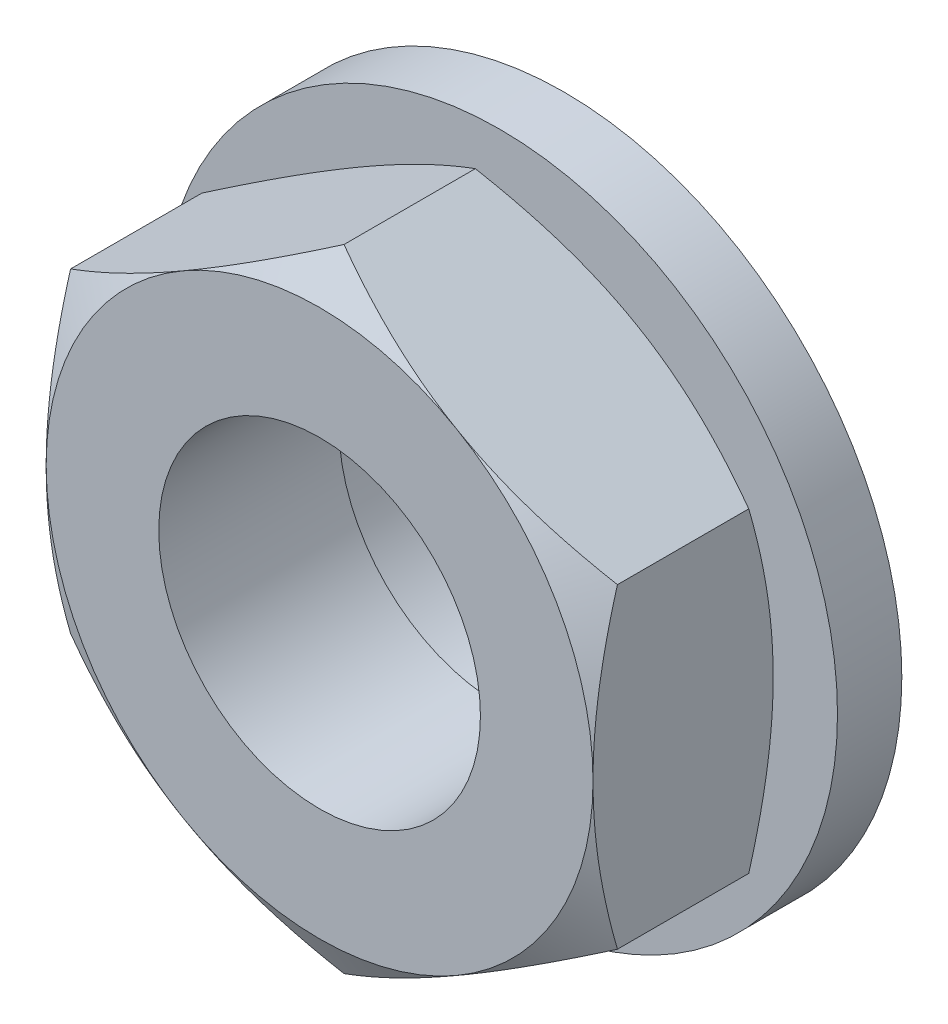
ISO-10303-21;
HEADER;
FILE_DESCRIPTION(('STEP AP214'),'2;1');
FILE_NAME('part.step','',(''),(''),'','','');
FILE_SCHEMA(('AUTOMOTIVE_DESIGN { 1 0 10303 214 1 1 1 1 }'));
ENDSEC;
DATA;
#1=APPLICATION_CONTEXT('core data for automotive mechanical design processes');
#2=APPLICATION_PROTOCOL_DEFINITION('international standard','automotive_design',2000,#1);
#3=PRODUCT_CONTEXT('',#1,'mechanical');
#4=PRODUCT('Part','Part','',(#3));
#5=PRODUCT_RELATED_PRODUCT_CATEGORY('part','',(#4));
#6=PRODUCT_DEFINITION_FORMATION('','',#4);
#7=PRODUCT_DEFINITION_CONTEXT('part definition',#1,'design');
#8=PRODUCT_DEFINITION('design','',#6,#7);
#9=PRODUCT_DEFINITION_SHAPE('','',#8);
#10=(LENGTH_UNIT() NAMED_UNIT(*) SI_UNIT(.MILLI.,.METRE.));
#11=(NAMED_UNIT(*) PLANE_ANGLE_UNIT() SI_UNIT($,.RADIAN.));
#12=(NAMED_UNIT(*) SI_UNIT($,.STERADIAN.) SOLID_ANGLE_UNIT());
#13=UNCERTAINTY_MEASURE_WITH_UNIT(LENGTH_MEASURE(1.E-05),#10,'distance_accuracy_value','');
#14=(GEOMETRIC_REPRESENTATION_CONTEXT(3) GLOBAL_UNCERTAINTY_ASSIGNED_CONTEXT((#13)) GLOBAL_UNIT_ASSIGNED_CONTEXT((#10,
#11,#12)) REPRESENTATION_CONTEXT('',''));
#15=CARTESIAN_POINT('',(0.,0.,0.));
#16=DIRECTION('',(0.,0.,1.));
#17=DIRECTION('',(1.,0.,0.));
#18=AXIS2_PLACEMENT_3D('',#15,#16,#17);
#19=CARTESIAN_POINT('',(8.5,4.90747728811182,7.6));
#20=DIRECTION('',(-0.5,-0.866025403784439,0.));
#21=DIRECTION('',(0.866025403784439,-0.5,0.));
#22=AXIS2_PLACEMENT_3D('',#19,#20,#21);
#23=PLANE('',#22);
#24=CARTESIAN_POINT('',(-0.000199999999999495,9.81507004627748,2.75925604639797));
#25=CARTESIAN_POINT('',(0.186639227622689,9.70719836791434,2.69698613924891));
#26=CARTESIAN_POINT('',(0.374175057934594,9.59892450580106,2.63754229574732));
#27=CARTESIAN_POINT('',(0.75076975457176,9.3814974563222,2.52508511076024));
#28=CARTESIAN_POINT('',(0.939829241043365,9.27234391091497,2.47207454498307));
#29=CARTESIAN_POINT('',(1.5100347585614,8.94313560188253,2.32373338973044));
#30=CARTESIAN_POINT('',(1.89343164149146,8.72178130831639,2.23935892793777));
#31=CARTESIAN_POINT('',(2.46717766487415,8.39052888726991,2.14042001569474));
#32=CARTESIAN_POINT('',(2.65581276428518,8.28162036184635,2.11223519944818));
#33=CARTESIAN_POINT('',(3.0339360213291,8.06331079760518,2.06497408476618));
#34=CARTESIAN_POINT('',(3.22342410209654,7.95390980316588,2.04589698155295));
#35=CARTESIAN_POINT('',(3.6027265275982,7.73491944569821,2.01733477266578));
#36=CARTESIAN_POINT('',(3.79254025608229,7.62533043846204,2.00783878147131));
#37=CARTESIAN_POINT('',(4.17234305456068,7.40605119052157,1.99864237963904));
#38=CARTESIAN_POINT('',(4.36233211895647,7.29636095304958,1.99894166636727));
#39=CARTESIAN_POINT('',(4.71752301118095,7.09129139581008,2.00865447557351));
#40=CARTESIAN_POINT('',(4.8827499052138,6.99589760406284,2.01688316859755));
#41=CARTESIAN_POINT('',(5.21281671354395,6.80533344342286,2.04058924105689));
#42=CARTESIAN_POINT('',(5.37765660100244,6.71016309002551,2.05606710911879));
#43=CARTESIAN_POINT('',(5.87153810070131,6.42502047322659,2.11300862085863));
#44=CARTESIAN_POINT('',(6.19970550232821,6.23555293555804,2.1649730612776));
#45=CARTESIAN_POINT('',(6.85952142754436,5.8546080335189,2.29488494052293));
#46=CARTESIAN_POINT('',(7.19108574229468,5.66317928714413,2.37338306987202));
#47=CARTESIAN_POINT('',(7.84926989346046,5.28317649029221,2.55154133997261));
#48=CARTESIAN_POINT('',(8.17589815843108,5.09459757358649,2.65115963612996));
#49=CARTESIAN_POINT('',(8.5002,4.90736181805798,2.75925604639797));
#50=B_SPLINE_CURVE_WITH_KNOTS('',3,(#24,#25,#26,#27,#28,#29,#30,#31,#32,#33,#34,#35,#36,#37,#38,
#39,#40,#41,#42,#43,#44,#45,#46,#47,#48,#49),.UNSPECIFIED.,.F.,.F.,(4,2,2,2,2,2,2,2,2,2,2,2,4),
(0.,0.673596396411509,1.34748239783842,2.69805431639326,3.356799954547,4.01548737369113,
4.67342558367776,5.33134346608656,5.9040955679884,6.47688628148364,7.62328361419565,
8.79510569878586,9.96462743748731),.UNSPECIFIED.);
#51=CARTESIAN_POINT('',(0.,9.81495457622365,2.75918937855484));
#52=VERTEX_POINT('',#51);
#53=CARTESIAN_POINT('',(4.25,7.36121593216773,2.));
#54=VERTEX_POINT('',#53);
#55=EDGE_CURVE('E116',#52,#54,#50,.T.);
#56=ORIENTED_EDGE('',*,*,#55,.F.);
#57=DIRECTION('',(0.,0.,-1.));
#58=VECTOR('',#57,1.);
#59=CARTESIAN_POINT('',(0.,9.81495457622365,7.6));
#60=LINE('',#59,#58);
#61=CARTESIAN_POINT('',(0.,9.81495457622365,6.84081062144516));
#62=VERTEX_POINT('',#61);
#63=EDGE_CURVE('E143',#62,#52,#60,.T.);
#64=ORIENTED_EDGE('',*,*,#63,.F.);
#65=CARTESIAN_POINT('',(8.5002,4.90736181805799,6.84074395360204));
#66=CARTESIAN_POINT('',(8.31336077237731,5.01523349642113,6.90301386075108));
#67=CARTESIAN_POINT('',(8.1258249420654,5.12350735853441,6.96245770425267));
#68=CARTESIAN_POINT('',(7.74923024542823,5.34093440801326,7.07491488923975));
#69=CARTESIAN_POINT('',(7.56017075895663,5.45008795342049,7.12792545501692));
#70=CARTESIAN_POINT('',(6.9899652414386,5.77929626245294,7.27626661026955));
#71=CARTESIAN_POINT('',(6.60656835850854,6.00065055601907,7.36064107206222));
#72=CARTESIAN_POINT('',(6.03282233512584,6.33190297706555,7.45957998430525));
#73=CARTESIAN_POINT('',(5.84418723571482,6.44081150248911,7.48776480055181));
#74=CARTESIAN_POINT('',(5.46606397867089,6.65912106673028,7.5350259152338));
#75=CARTESIAN_POINT('',(5.27657589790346,6.76852206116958,7.55410301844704));
#76=CARTESIAN_POINT('',(4.8972734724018,6.98751241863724,7.5826652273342));
#77=CARTESIAN_POINT('',(4.70745974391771,7.09710142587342,7.59216121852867));
#78=CARTESIAN_POINT('',(4.32765694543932,7.31638067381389,7.60135762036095));
#79=CARTESIAN_POINT('',(4.13766788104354,7.42607091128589,7.60105833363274));
#80=CARTESIAN_POINT('',(3.78247698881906,7.63114046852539,7.5913455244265));
#81=CARTESIAN_POINT('',(3.61725009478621,7.72653426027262,7.58311683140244));
#82=CARTESIAN_POINT('',(3.28718328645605,7.9170984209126,7.55941075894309));
#83=CARTESIAN_POINT('',(3.12234339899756,8.01226877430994,7.5439328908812));
#84=CARTESIAN_POINT('',(2.62846189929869,8.29741139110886,7.48699137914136));
#85=CARTESIAN_POINT('',(2.30029449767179,8.48687892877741,7.43502693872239));
#86=CARTESIAN_POINT('',(1.64047857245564,8.86782383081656,7.30511505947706));
#87=CARTESIAN_POINT('',(1.30891425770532,9.05925257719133,7.22661693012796));
#88=CARTESIAN_POINT('',(0.650730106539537,9.43925537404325,7.04845866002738));
#89=CARTESIAN_POINT('',(0.324101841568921,9.62783429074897,6.94884036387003));
#90=CARTESIAN_POINT('',(-0.000200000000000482,9.81507004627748,6.84074395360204));
#91=B_SPLINE_CURVE_WITH_KNOTS('',3,(#65,#66,#67,#68,#69,#70,#71,#72,#73,#74,#75,#76,#77,#78,#79,
#80,#81,#82,#83,#84,#85,#86,#87,#88,#89,#90),.UNSPECIFIED.,.F.,.F.,(4,2,2,2,2,2,2,2,2,2,2,2,4),
(0.,0.673596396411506,1.34748239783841,2.69805431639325,3.35679995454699,4.01548737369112,
4.67342558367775,5.33134346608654,5.90409556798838,6.47688628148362,7.62328361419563,
8.79510569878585,9.96462743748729),.UNSPECIFIED.);
#92=CARTESIAN_POINT('',(4.25,7.36121593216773,7.6));
#93=VERTEX_POINT('',#92);
#94=EDGE_CURVE('E208',#93,#62,#91,.T.);
#95=ORIENTED_EDGE('',*,*,#94,.F.);
#96=CARTESIAN_POINT('',(8.5,4.90747728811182,6.84081062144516));
#97=VERTEX_POINT('',#96);
#98=EDGE_CURVE('E215',#97,#93,#91,.T.);
#99=ORIENTED_EDGE('',*,*,#98,.F.);
#100=DIRECTION('',(0.,0.,-1.));
#101=VECTOR('',#100,1.);
#102=CARTESIAN_POINT('',(8.5,4.90747728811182,7.6));
#103=LINE('',#102,#101);
#104=CARTESIAN_POINT('',(8.5,4.90747728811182,2.75918937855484));
#105=VERTEX_POINT('',#104);
#106=EDGE_CURVE('E226',#97,#105,#103,.T.);
#107=ORIENTED_EDGE('',*,*,#106,.T.);
#108=EDGE_CURVE('E195',#54,#105,#50,.T.);
#109=ORIENTED_EDGE('',*,*,#108,.F.);
#110=EDGE_LOOP('',(#56,#64,#95,#99,#107,#109));
#111=FACE_BOUND('',#110,.T.);
#112=ADVANCED_FACE('F14',(#111),#23,.F.);
#113=CARTESIAN_POINT('',(0.,9.81495457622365,7.6));
#114=DIRECTION('',(0.5,-0.866025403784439,0.));
#115=DIRECTION('',(0.866025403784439,0.5,0.));
#116=AXIS2_PLACEMENT_3D('',#113,#114,#115);
#117=PLANE('',#116);
#118=CARTESIAN_POINT('',(-8.5002,4.90736181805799,2.75925604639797));
#119=CARTESIAN_POINT('',(-8.31336077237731,5.01523349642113,2.69698613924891));
#120=CARTESIAN_POINT('',(-8.12582494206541,5.12350735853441,2.63754229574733));
#121=CARTESIAN_POINT('',(-7.74923024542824,5.34093440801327,2.52508511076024));
#122=CARTESIAN_POINT('',(-7.56017075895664,5.4500879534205,2.47207454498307));
#123=CARTESIAN_POINT('',(-6.98996524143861,5.77929626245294,2.32373338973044));
#124=CARTESIAN_POINT('',(-6.60656835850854,6.00065055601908,2.23935892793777));
#125=CARTESIAN_POINT('',(-6.03282233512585,6.33190297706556,2.14042001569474));
#126=CARTESIAN_POINT('',(-5.84418723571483,6.44081150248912,2.11223519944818));
#127=CARTESIAN_POINT('',(-5.4660639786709,6.65912106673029,2.06497408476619));
#128=CARTESIAN_POINT('',(-5.27657589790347,6.76852206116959,2.04589698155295));
#129=CARTESIAN_POINT('',(-4.89727347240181,6.98751241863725,2.01733477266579));
#130=CARTESIAN_POINT('',(-4.70745974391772,7.09710142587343,2.00783878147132));
#131=CARTESIAN_POINT('',(-4.32765694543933,7.3163806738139,1.99864237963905));
#132=CARTESIAN_POINT('',(-4.13766788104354,7.42607091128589,1.99894166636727));
#133=CARTESIAN_POINT('',(-3.78247698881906,7.63114046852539,2.00865447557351));
#134=CARTESIAN_POINT('',(-3.61725009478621,7.72653426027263,2.01688316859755));
#135=CARTESIAN_POINT('',(-3.28718328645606,7.91709842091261,2.04058924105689));
#136=CARTESIAN_POINT('',(-3.12234339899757,8.01226877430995,2.05606710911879));
#137=CARTESIAN_POINT('',(-2.6284618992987,8.29741139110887,2.11300862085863));
#138=CARTESIAN_POINT('',(-2.3002944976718,8.48687892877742,2.1649730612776));
#139=CARTESIAN_POINT('',(-1.64047857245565,8.86782383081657,2.29488494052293));
#140=CARTESIAN_POINT('',(-1.30891425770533,9.05925257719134,2.37338306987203));
#141=CARTESIAN_POINT('',(-0.65073010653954,9.43925537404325,2.55154133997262));
#142=CARTESIAN_POINT('',(-0.324101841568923,9.62783429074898,2.65115963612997));
#143=CARTESIAN_POINT('',(0.000199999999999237,9.81507004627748,2.75925604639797));
#144=B_SPLINE_CURVE_WITH_KNOTS('',3,(#118,#119,#120,#121,#122,#123,#124,#125,#126,#127,#128,
#129,#130,#131,#132,#133,#134,#135,#136,#137,#138,#139,#140,#141,#142,#143),.UNSPECIFIED.,.F.,
.F.,(4,2,2,2,2,2,2,2,2,2,2,2,4),(0.,0.673596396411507,1.34748239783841,2.69805431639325,
3.35679995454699,4.01548737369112,4.67342558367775,5.33134346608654,5.90409556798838,
6.47688628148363,7.62328361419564,8.79510569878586,9.9646274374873),.UNSPECIFIED.);
#145=CARTESIAN_POINT('',(-8.5,4.90747728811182,2.75918937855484));
#146=VERTEX_POINT('',#145);
#147=CARTESIAN_POINT('',(-4.25,7.36121593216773,2.));
#148=VERTEX_POINT('',#147);
#149=EDGE_CURVE('E124',#146,#148,#144,.T.);
#150=ORIENTED_EDGE('',*,*,#149,.F.);
#151=DIRECTION('',(0.,0.,-1.));
#152=VECTOR('',#151,1.);
#153=CARTESIAN_POINT('',(-8.5,4.90747728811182,7.6));
#154=LINE('',#153,#152);
#155=CARTESIAN_POINT('',(-8.5,4.90747728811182,6.84081062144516));
#156=VERTEX_POINT('',#155);
#157=EDGE_CURVE('E240',#156,#146,#154,.T.);
#158=ORIENTED_EDGE('',*,*,#157,.F.);
#159=CARTESIAN_POINT('',(0.000200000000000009,9.81507004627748,6.84074395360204));
#160=CARTESIAN_POINT('',(-0.186639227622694,9.70719836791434,6.90301386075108));
#161=CARTESIAN_POINT('',(-0.374175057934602,9.59892450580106,6.96245770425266));
#162=CARTESIAN_POINT('',(-0.750769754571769,9.38149745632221,7.07491488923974));
#163=CARTESIAN_POINT('',(-0.939829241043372,9.27234391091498,7.12792545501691));
#164=CARTESIAN_POINT('',(-1.5100347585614,8.94313560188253,7.27626661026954));
#165=CARTESIAN_POINT('',(-1.89343164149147,8.72178130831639,7.36064107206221));
#166=CARTESIAN_POINT('',(-2.46717766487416,8.39052888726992,7.45957998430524));
#167=CARTESIAN_POINT('',(-2.65581276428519,8.28162036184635,7.4877648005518));
#168=CARTESIAN_POINT('',(-3.03393602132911,8.06331079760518,7.5350259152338));
#169=CARTESIAN_POINT('',(-3.22342410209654,7.95390980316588,7.55410301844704));
#170=CARTESIAN_POINT('',(-3.6027265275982,7.73491944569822,7.58266522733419));
#171=CARTESIAN_POINT('',(-3.79254025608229,7.62533043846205,7.59216121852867));
#172=CARTESIAN_POINT('',(-4.17234305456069,7.40605119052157,7.60135762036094));
#173=CARTESIAN_POINT('',(-4.36233211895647,7.29636095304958,7.60105833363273));
#174=CARTESIAN_POINT('',(-4.71752301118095,7.09129139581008,7.59134552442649));
#175=CARTESIAN_POINT('',(-4.8827499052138,6.99589760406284,7.58311683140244));
#176=CARTESIAN_POINT('',(-5.21281671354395,6.80533344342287,7.55941075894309));
#177=CARTESIAN_POINT('',(-5.37765660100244,6.71016309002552,7.54393289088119));
#178=CARTESIAN_POINT('',(-5.87153810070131,6.4250204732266,7.48699137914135));
#179=CARTESIAN_POINT('',(-6.19970550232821,6.23555293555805,7.43502693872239));
#180=CARTESIAN_POINT('',(-6.85952142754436,5.85460803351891,7.30511505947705));
#181=CARTESIAN_POINT('',(-7.19108574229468,5.66317928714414,7.22661693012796));
#182=CARTESIAN_POINT('',(-7.84926989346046,5.28317649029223,7.04845866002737));
#183=CARTESIAN_POINT('',(-8.17589815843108,5.0945975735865,6.94884036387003));
#184=CARTESIAN_POINT('',(-8.5002,4.90736181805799,6.84074395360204));
#185=B_SPLINE_CURVE_WITH_KNOTS('',3,(#159,#160,#161,#162,#163,#164,#165,#166,#167,#168,#169,
#170,#171,#172,#173,#174,#175,#176,#177,#178,#179,#180,#181,#182,#183,#184),.UNSPECIFIED.,.F.,
.F.,(4,2,2,2,2,2,2,2,2,2,2,2,4),(0.,0.673596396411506,1.34748239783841,2.69805431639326,
3.35679995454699,4.01548737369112,4.67342558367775,5.33134346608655,5.90409556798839,
6.47688628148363,7.62328361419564,8.79510569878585,9.96462743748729),.UNSPECIFIED.);
#186=CARTESIAN_POINT('',(-4.25,7.36121593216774,7.6));
#187=VERTEX_POINT('',#186);
#188=EDGE_CURVE('E217',#187,#156,#185,.T.);
#189=ORIENTED_EDGE('',*,*,#188,.F.);
#190=EDGE_CURVE('E216',#62,#187,#185,.T.);
#191=ORIENTED_EDGE('',*,*,#190,.F.);
#192=ORIENTED_EDGE('',*,*,#63,.T.);
#193=EDGE_CURVE('E114',#148,#52,#144,.T.);
#194=ORIENTED_EDGE('',*,*,#193,.F.);
#195=EDGE_LOOP('',(#150,#158,#189,#191,#192,#194));
#196=FACE_BOUND('',#195,.T.);
#197=ADVANCED_FACE('F140',(#196),#117,.F.);
#198=CARTESIAN_POINT('',(-8.5,4.90747728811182,7.6));
#199=DIRECTION('',(1.,0.,0.));
#200=DIRECTION('',(0.,1.,0.));
#201=AXIS2_PLACEMENT_3D('',#198,#199,#200);
#202=PLANE('',#201);
#203=CARTESIAN_POINT('',(-8.5,-13.1098417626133,6.11320175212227));
#204=CARTESIAN_POINT('',(-8.5,-12.7391954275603,5.93369675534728));
#205=CARTESIAN_POINT('',(-8.5,-12.3676904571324,5.75593394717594));
#206=CARTESIAN_POINT('',(-8.5,-11.6225063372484,5.40487402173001));
#207=CARTESIAN_POINT('',(-8.5,-11.2488268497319,5.23157762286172));
#208=CARTESIAN_POINT('',(-8.5,-10.496876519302,4.88954442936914));
#209=CARTESIAN_POINT('',(-8.5,-10.11859170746,4.72083823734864));
#210=CARTESIAN_POINT('',(-8.5,-9.35898804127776,4.39042698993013));
#211=CARTESIAN_POINT('',(-8.5,-8.97766933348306,4.2287215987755));
#212=CARTESIAN_POINT('',(-8.5,-8.19935475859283,3.90922176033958));
#213=CARTESIAN_POINT('',(-8.5,-7.80224246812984,3.75170933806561));
#214=CARTESIAN_POINT('',(-8.5,-7.0033462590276,3.44878149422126));
#215=CARTESIAN_POINT('',(-8.5,-6.60156181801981,3.30336744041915));
#216=CARTESIAN_POINT('',(-8.5,-5.79345296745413,3.02850734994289));
#217=CARTESIAN_POINT('',(-8.5,-5.38713989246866,2.89902835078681));
#218=CARTESIAN_POINT('',(-8.5,-4.56870092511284,2.66023889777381));
#219=CARTESIAN_POINT('',(-8.5,-4.15657693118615,2.55092201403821));
#220=CARTESIAN_POINT('',(-8.5,-3.32849200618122,2.35833664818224));
#221=CARTESIAN_POINT('',(-8.5,-2.91256426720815,2.27492933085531));
#222=CARTESIAN_POINT('',(-8.5,-2.28494353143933,2.17289615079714));
#223=CARTESIAN_POINT('',(-8.5,-2.07509909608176,2.14272998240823));
#224=CARTESIAN_POINT('',(-8.5,-1.65439193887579,2.09068352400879));
#225=CARTESIAN_POINT('',(-8.5,-1.44352931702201,2.06880243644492));
#226=CARTESIAN_POINT('',(-8.5,-1.02379063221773,2.03403273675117));
#227=CARTESIAN_POINT('',(-8.5,-0.814923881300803,2.02103213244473));
#228=CARTESIAN_POINT('',(-8.5,-0.396828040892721,2.00387004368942));
#229=CARTESIAN_POINT('',(-8.5,-0.187598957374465,1.99970841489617));
#230=CARTESIAN_POINT('',(-8.5,0.230848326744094,2.00032334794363));
#231=CARTESIAN_POINT('',(-8.5,0.440066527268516,2.00509996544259));
#232=CARTESIAN_POINT('',(-8.5,0.858117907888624,2.02347603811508));
#233=CARTESIAN_POINT('',(-8.5,1.06695106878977,2.03707592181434));
#234=CARTESIAN_POINT('',(-8.5,1.57106179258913,2.08026921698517));
#235=CARTESIAN_POINT('',(-8.5,1.86597643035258,2.11417214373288));
#236=CARTESIAN_POINT('',(-8.5,2.45357067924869,2.1977103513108));
#237=CARTESIAN_POINT('',(-8.5,2.74624997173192,2.24734783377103));
#238=CARTESIAN_POINT('',(-8.5,3.32911080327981,2.36058919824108));
#239=CARTESIAN_POINT('',(-8.5,3.61929015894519,2.42420421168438));
#240=CARTESIAN_POINT('',(-8.5,4.19671546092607,2.56346348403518));
#241=CARTESIAN_POINT('',(-8.5,4.48396145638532,2.63910754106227));
#242=CARTESIAN_POINT('',(-8.5,5.06177077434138,2.80235788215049));
#243=CARTESIAN_POINT('',(-8.5,5.35227022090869,2.89018869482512));
#244=CARTESIAN_POINT('',(-8.5,5.93040676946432,3.07476618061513));
#245=CARTESIAN_POINT('',(-8.5,6.21804385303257,3.17151291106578));
#246=CARTESIAN_POINT('',(-8.5,6.79060039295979,3.37240011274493));
#247=CARTESIAN_POINT('',(-8.5,7.07552075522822,3.47653801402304));
#248=CARTESIAN_POINT('',(-8.5,7.64301148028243,3.69099806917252));
#249=CARTESIAN_POINT('',(-8.5,7.92558186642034,3.80132016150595));
#250=CARTESIAN_POINT('',(-8.5,8.57470163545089,4.06163305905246));
#251=CARTESIAN_POINT('',(-8.5,8.94052064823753,4.21344201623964));
#252=CARTESIAN_POINT('',(-8.5,9.66918688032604,4.52405124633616));
#253=CARTESIAN_POINT('',(-8.5,10.032033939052,4.6828518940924));
#254=CARTESIAN_POINT('',(-8.5,10.7552864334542,5.0060929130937));
#255=CARTESIAN_POINT('',(-8.5,11.1156913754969,5.17053438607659));
#256=CARTESIAN_POINT('',(-8.5,11.8343806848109,5.5039602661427));
#257=CARTESIAN_POINT('',(-8.5,12.1926650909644,5.67294458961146));
#258=CARTESIAN_POINT('',(-8.5,12.9078084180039,6.0148032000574));
#259=CARTESIAN_POINT('',(-8.5,13.264665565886,6.18768119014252));
#260=CARTESIAN_POINT('',(-8.5,13.9768696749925,6.53652317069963));
#261=CARTESIAN_POINT('',(-8.5,14.332216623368,6.71248718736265));
#262=CARTESIAN_POINT('',(-8.5,15.3962572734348,7.24417106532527));
#263=CARTESIAN_POINT('',(-8.5,16.1030357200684,7.60372367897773));
#264=CARTESIAN_POINT('',(-8.5,17.4566110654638,8.30112194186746));
#265=CARTESIAN_POINT('',(-8.5,18.1036957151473,8.63841152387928));
#266=CARTESIAN_POINT('',(-8.5,19.3954345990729,9.31765809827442));
#267=CARTESIAN_POINT('',(-8.5,20.0400887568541,9.65961523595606));
#268=CARTESIAN_POINT('',(-8.5,21.3260050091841,10.3463113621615));
#269=CARTESIAN_POINT('',(-8.5,21.9672714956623,10.6910421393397));
#270=CARTESIAN_POINT('',(-8.5,23.248239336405,11.3833227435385));
#271=CARTESIAN_POINT('',(-8.5,23.8879407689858,11.7308724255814));
#272=CARTESIAN_POINT('',(-8.5,24.5270609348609,12.079480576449));
#273=B_SPLINE_CURVE_WITH_KNOTS('',3,(#203,#204,#205,#206,#207,#208,#209,#210,#211,#212,#213,
#214,#215,#216,#217,#218,#219,#220,#221,#222,#223,#224,#225,#226,#227,#228,#229,#230,#231,#232,
#233,#234,#235,#236,#237,#238,#239,#240,#241,#242,#243,#244,#245,#246,#247,#248,#249,#250,#251,
#252,#253,#254,#255,#256,#257,#258,#259,#260,#261,#262,#263,#264,#265,#266,#267,#268,#269,#270,
#271,#272),.UNSPECIFIED.,.F.,.F.,(4,2,2,2,2,2,2,2,2,2,2,2,2,2,2,2,2,2,2,2,2,2,2,2,2,2,2,2,2,2,2,
2,2,2,4),(0.,1.2354937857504,2.47118507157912,3.71372659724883,4.95620846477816,
6.23768538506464,7.51930698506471,8.79823126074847,10.0767469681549,11.3482886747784,
11.9841556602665,12.6199614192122,13.2475931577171,13.8752146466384,14.5028400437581,
15.1304959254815,16.0205726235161,16.9107739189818,17.8016867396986,18.6925846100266,
19.6028733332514,20.5131679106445,21.4231475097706,22.3331180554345,23.5212239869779,
24.7093936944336,25.8977968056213,27.086178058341,28.2757417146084,29.4653154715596,
31.8441801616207,34.0333023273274,36.2224927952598,38.4066460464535,40.5906876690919),.UNSPECIFIED.);
#274=CARTESIAN_POINT('',(-8.5,-4.90747728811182,2.75918937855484));
#275=VERTEX_POINT('',#274);
#276=CARTESIAN_POINT('',(-8.5,0.,2.));
#277=VERTEX_POINT('',#276);
#278=EDGE_CURVE('E336',#275,#277,#273,.T.);
#279=ORIENTED_EDGE('',*,*,#278,.F.);
#280=DIRECTION('',(0.,0.,-1.));
#281=VECTOR('',#280,1.);
#282=CARTESIAN_POINT('',(-8.5,-4.90747728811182,7.6));
#283=LINE('',#282,#281);
#284=CARTESIAN_POINT('',(-8.5,-4.90747728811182,6.84081062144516));
#285=VERTEX_POINT('',#284);
#286=EDGE_CURVE('E237',#285,#275,#283,.T.);
#287=ORIENTED_EDGE('',*,*,#286,.F.);
#288=CARTESIAN_POINT('',(-8.5,-13.1098417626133,3.48679824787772));
#289=CARTESIAN_POINT('',(-8.5,-12.7391954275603,3.66630324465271));
#290=CARTESIAN_POINT('',(-8.5,-12.3676904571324,3.84406605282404));
#291=CARTESIAN_POINT('',(-8.5,-11.6225063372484,4.19512597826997));
#292=CARTESIAN_POINT('',(-8.5,-11.2488268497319,4.36842237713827));
#293=CARTESIAN_POINT('',(-8.5,-10.496876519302,4.71045557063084));
#294=CARTESIAN_POINT('',(-8.5,-10.11859170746,4.87916176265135));
#295=CARTESIAN_POINT('',(-8.5,-9.35898804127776,5.20957301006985));
#296=CARTESIAN_POINT('',(-8.5,-8.97766933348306,5.37127840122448));
#297=CARTESIAN_POINT('',(-8.5,-8.19935475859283,5.69077823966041));
#298=CARTESIAN_POINT('',(-8.5,-7.80224246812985,5.84829066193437));
#299=CARTESIAN_POINT('',(-8.5,-7.0033462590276,6.15121850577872));
#300=CARTESIAN_POINT('',(-8.5,-6.60156181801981,6.29663255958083));
#301=CARTESIAN_POINT('',(-8.5,-5.79345296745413,6.5714926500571));
#302=CARTESIAN_POINT('',(-8.5,-5.38713989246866,6.70097164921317));
#303=CARTESIAN_POINT('',(-8.5,-4.56870092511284,6.93976110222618));
#304=CARTESIAN_POINT('',(-8.5,-4.15657693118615,7.04907798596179));
#305=CARTESIAN_POINT('',(-8.5,-3.32849200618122,7.24166335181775));
#306=CARTESIAN_POINT('',(-8.5,-2.91256426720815,7.32507066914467));
#307=CARTESIAN_POINT('',(-8.5,-2.28494353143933,7.42710384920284));
#308=CARTESIAN_POINT('',(-8.5,-2.07509909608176,7.45727001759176));
#309=CARTESIAN_POINT('',(-8.5,-1.65439193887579,7.5093164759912));
#310=CARTESIAN_POINT('',(-8.5,-1.44352931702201,7.53119756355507));
#311=CARTESIAN_POINT('',(-8.5,-1.02379063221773,7.56596726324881));
#312=CARTESIAN_POINT('',(-8.5,-0.814923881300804,7.57896786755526));
#313=CARTESIAN_POINT('',(-8.5,-0.396828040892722,7.59612995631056));
#314=CARTESIAN_POINT('',(-8.5,-0.187598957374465,7.60029158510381));
#315=CARTESIAN_POINT('',(-8.5,0.230848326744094,7.59967665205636));
#316=CARTESIAN_POINT('',(-8.5,0.440066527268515,7.59490003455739));
#317=CARTESIAN_POINT('',(-8.5,0.858117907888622,7.57652396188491));
#318=CARTESIAN_POINT('',(-8.5,1.06695106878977,7.56292407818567));
#319=CARTESIAN_POINT('',(-8.5,1.57106179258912,7.51973078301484));
#320=CARTESIAN_POINT('',(-8.5,1.86597643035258,7.48582785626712));
#321=CARTESIAN_POINT('',(-8.5,2.45357067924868,7.40228964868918));
#322=CARTESIAN_POINT('',(-8.5,2.74624997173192,7.35265216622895));
#323=CARTESIAN_POINT('',(-8.5,3.3291108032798,7.23941080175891));
#324=CARTESIAN_POINT('',(-8.5,3.61929015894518,7.17579578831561));
#325=CARTESIAN_POINT('',(-8.5,4.19671546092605,7.03653651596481));
#326=CARTESIAN_POINT('',(-8.5,4.48396145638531,6.96089245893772));
#327=CARTESIAN_POINT('',(-8.5,5.06177077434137,6.79764211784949));
#328=CARTESIAN_POINT('',(-8.5,5.35227022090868,6.70981130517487));
#329=CARTESIAN_POINT('',(-8.5,5.93040676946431,6.52523381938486));
#330=CARTESIAN_POINT('',(-8.5,6.21804385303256,6.42848708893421));
#331=CARTESIAN_POINT('',(-8.5,6.79060039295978,6.22759988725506));
#332=CARTESIAN_POINT('',(-8.5,7.07552075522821,6.12346198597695));
#333=CARTESIAN_POINT('',(-8.5,7.64301148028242,5.90900193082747));
#334=CARTESIAN_POINT('',(-8.5,7.92558186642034,5.79867983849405));
#335=CARTESIAN_POINT('',(-8.5,8.57470163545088,5.53836694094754));
#336=CARTESIAN_POINT('',(-8.5,8.94052064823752,5.38655798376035));
#337=CARTESIAN_POINT('',(-8.5,9.66918688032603,5.07594875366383));
#338=CARTESIAN_POINT('',(-8.5,10.032033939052,4.91714810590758));
#339=CARTESIAN_POINT('',(-8.5,10.7552864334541,4.5939070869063));
#340=CARTESIAN_POINT('',(-8.5,11.1156913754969,4.4294656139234));
#341=CARTESIAN_POINT('',(-8.5,11.8343806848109,4.09603973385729));
#342=CARTESIAN_POINT('',(-8.5,12.1926650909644,3.92705541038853));
#343=CARTESIAN_POINT('',(-8.5,12.9078084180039,3.58519679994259));
#344=CARTESIAN_POINT('',(-8.5,13.264665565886,3.41231880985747));
#345=CARTESIAN_POINT('',(-8.5,13.9768696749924,3.06347682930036));
#346=CARTESIAN_POINT('',(-8.5,14.332216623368,2.88751281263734));
#347=CARTESIAN_POINT('',(-8.5,15.3962572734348,2.35582893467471));
#348=CARTESIAN_POINT('',(-8.5,16.1030357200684,1.99627632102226));
#349=CARTESIAN_POINT('',(-8.5,17.4566110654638,1.29887805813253));
#350=CARTESIAN_POINT('',(-8.5,18.1036957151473,0.961588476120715));
#351=CARTESIAN_POINT('',(-8.5,19.3954345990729,0.282341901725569));
#352=CARTESIAN_POINT('',(-8.5,20.0400887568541,-0.0596152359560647));
#353=CARTESIAN_POINT('',(-8.5,21.3260050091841,-0.746311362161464));
#354=CARTESIAN_POINT('',(-8.5,21.9672714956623,-1.09104213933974));
#355=CARTESIAN_POINT('',(-8.5,23.248239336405,-1.78332274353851));
#356=CARTESIAN_POINT('',(-8.5,23.8879407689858,-2.13087242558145));
#357=CARTESIAN_POINT('',(-8.5,24.5270609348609,-2.47948057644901));
#358=B_SPLINE_CURVE_WITH_KNOTS('',3,(#288,#289,#290,#291,#292,#293,#294,#295,#296,#297,#298,
#299,#300,#301,#302,#303,#304,#305,#306,#307,#308,#309,#310,#311,#312,#313,#314,#315,#316,#317,
#318,#319,#320,#321,#322,#323,#324,#325,#326,#327,#328,#329,#330,#331,#332,#333,#334,#335,#336,
#337,#338,#339,#340,#341,#342,#343,#344,#345,#346,#347,#348,#349,#350,#351,#352,#353,#354,#355,
#356,#357),.UNSPECIFIED.,.F.,.F.,(4,2,2,2,2,2,2,2,2,2,2,2,2,2,2,2,2,2,2,2,2,2,2,2,2,2,2,2,2,2,2,
2,2,2,4),(0.,1.2354937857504,2.47118507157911,3.71372659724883,4.95620846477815,
6.23768538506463,7.5193069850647,8.79823126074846,10.0767469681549,11.3482886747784,
11.9841556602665,12.6199614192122,13.2475931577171,13.8752146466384,14.5028400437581,
15.1304959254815,16.0205726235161,16.9107739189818,17.8016867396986,18.6925846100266,
19.6028733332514,20.5131679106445,21.4231475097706,22.3331180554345,23.5212239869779,
24.7093936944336,25.8977968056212,27.0861780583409,28.2757417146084,29.4653154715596,
31.8441801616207,34.0333023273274,36.2224927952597,38.4066460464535,40.5906876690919),.UNSPECIFIED.);
#359=CARTESIAN_POINT('',(-8.5,0.,7.6));
#360=VERTEX_POINT('',#359);
#361=EDGE_CURVE('E317',#360,#285,#358,.F.);
#362=ORIENTED_EDGE('',*,*,#361,.F.);
#363=EDGE_CURVE('E322',#156,#360,#358,.F.);
#364=ORIENTED_EDGE('',*,*,#363,.F.);
#365=ORIENTED_EDGE('',*,*,#157,.T.);
#366=EDGE_CURVE('E128',#277,#146,#273,.T.);
#367=ORIENTED_EDGE('',*,*,#366,.F.);
#368=EDGE_LOOP('',(#279,#287,#362,#364,#365,#367));
#369=FACE_BOUND('',#368,.T.);
#370=ADVANCED_FACE('F323',(#369),#202,.F.);
#371=CARTESIAN_POINT('',(-8.5,-4.90747728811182,7.6));
#372=DIRECTION('',(0.5,0.866025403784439,0.));
#373=DIRECTION('',(-0.866025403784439,0.5,0.));
#374=AXIS2_PLACEMENT_3D('',#371,#372,#373);
#375=PLANE('',#374);
#376=CARTESIAN_POINT('',(0.000199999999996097,-9.81507004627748,2.75925604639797));
#377=CARTESIAN_POINT('',(-0.186639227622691,-9.70719836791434,2.69698613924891));
#378=CARTESIAN_POINT('',(-0.374175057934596,-9.59892450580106,2.63754229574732));
#379=CARTESIAN_POINT('',(-0.750769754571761,-9.3814974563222,2.52508511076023));
#380=CARTESIAN_POINT('',(-0.939829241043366,-9.27234391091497,2.47207454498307));
#381=CARTESIAN_POINT('',(-1.5100347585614,-8.94313560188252,2.32373338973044));
#382=CARTESIAN_POINT('',(-1.89343164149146,-8.72178130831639,2.23935892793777));
#383=CARTESIAN_POINT('',(-2.46717766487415,-8.39052888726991,2.14042001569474));
#384=CARTESIAN_POINT('',(-2.65581276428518,-8.28162036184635,2.11223519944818));
#385=CARTESIAN_POINT('',(-3.0339360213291,-8.06331079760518,2.06497408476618));
#386=CARTESIAN_POINT('',(-3.22342410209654,-7.95390980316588,2.04589698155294));
#387=CARTESIAN_POINT('',(-3.6027265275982,-7.73491944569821,2.01733477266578));
#388=CARTESIAN_POINT('',(-3.79254025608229,-7.62533043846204,2.00783878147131));
#389=CARTESIAN_POINT('',(-4.17234305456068,-7.40605119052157,1.99864237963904));
#390=CARTESIAN_POINT('',(-4.36233211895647,-7.29636095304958,1.99894166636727));
#391=CARTESIAN_POINT('',(-4.71752301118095,-7.09129139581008,2.00865447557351));
#392=CARTESIAN_POINT('',(-4.8827499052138,-6.99589760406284,2.01688316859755));
#393=CARTESIAN_POINT('',(-5.21281671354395,-6.80533344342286,2.04058924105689));
#394=CARTESIAN_POINT('',(-5.37765660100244,-6.71016309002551,2.05606710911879));
#395=CARTESIAN_POINT('',(-5.87153810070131,-6.42502047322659,2.11300862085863));
#396=CARTESIAN_POINT('',(-6.19970550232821,-6.23555293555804,2.1649730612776));
#397=CARTESIAN_POINT('',(-6.85952142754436,-5.8546080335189,2.29488494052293));
#398=CARTESIAN_POINT('',(-7.19108574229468,-5.66317928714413,2.37338306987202));
#399=CARTESIAN_POINT('',(-7.84926989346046,-5.28317649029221,2.55154133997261));
#400=CARTESIAN_POINT('',(-8.17589815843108,-5.09459757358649,2.65115963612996));
#401=CARTESIAN_POINT('',(-8.5002,-4.90736181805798,2.75925604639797));
#402=B_SPLINE_CURVE_WITH_KNOTS('',3,(#376,#377,#378,#379,#380,#381,#382,#383,#384,#385,#386,
#387,#388,#389,#390,#391,#392,#393,#394,#395,#396,#397,#398,#399,#400,#401),.UNSPECIFIED.,.F.,
.F.,(4,2,2,2,2,2,2,2,2,2,2,2,4),(0.,0.673596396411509,1.34748239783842,2.69805431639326,
3.35679995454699,4.01548737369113,4.67342558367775,5.33134346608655,5.9040955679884,
6.47688628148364,7.62328361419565,8.79510569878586,9.96462743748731),.UNSPECIFIED.);
#403=CARTESIAN_POINT('',(0.,-9.81495457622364,2.75918937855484));
#404=VERTEX_POINT('',#403);
#405=CARTESIAN_POINT('',(-4.25,-7.36121593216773,2.));
#406=VERTEX_POINT('',#405);
#407=EDGE_CURVE('E144',#404,#406,#402,.T.);
#408=ORIENTED_EDGE('',*,*,#407,.F.);
#409=DIRECTION('',(0.,0.,-1.));
#410=VECTOR('',#409,1.);
#411=CARTESIAN_POINT('',(0.,-9.81495457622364,7.6));
#412=LINE('',#411,#410);
#413=CARTESIAN_POINT('',(0.,-9.81495457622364,6.84081062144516));
#414=VERTEX_POINT('',#413);
#415=EDGE_CURVE('E234',#414,#404,#412,.T.);
#416=ORIENTED_EDGE('',*,*,#415,.F.);
#417=CARTESIAN_POINT('',(-8.5002,-4.90736181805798,6.84074395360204));
#418=CARTESIAN_POINT('',(-8.31336077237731,-5.01523349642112,6.90301386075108));
#419=CARTESIAN_POINT('',(-8.1258249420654,-5.1235073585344,6.96245770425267));
#420=CARTESIAN_POINT('',(-7.74923024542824,-5.34093440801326,7.07491488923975));
#421=CARTESIAN_POINT('',(-7.56017075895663,-5.45008795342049,7.12792545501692));
#422=CARTESIAN_POINT('',(-6.9899652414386,-5.77929626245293,7.27626661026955));
#423=CARTESIAN_POINT('',(-6.60656835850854,-6.00065055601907,7.36064107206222));
#424=CARTESIAN_POINT('',(-6.03282233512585,-6.33190297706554,7.45957998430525));
#425=CARTESIAN_POINT('',(-5.84418723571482,-6.44081150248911,7.4877648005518));
#426=CARTESIAN_POINT('',(-5.4660639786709,-6.65912106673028,7.5350259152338));
#427=CARTESIAN_POINT('',(-5.27657589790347,-6.76852206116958,7.55410301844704));
#428=CARTESIAN_POINT('',(-4.89727347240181,-6.98751241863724,7.5826652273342));
#429=CARTESIAN_POINT('',(-4.70745974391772,-7.09710142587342,7.59216121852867));
#430=CARTESIAN_POINT('',(-4.32765694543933,-7.31638067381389,7.60135762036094));
#431=CARTESIAN_POINT('',(-4.13766788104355,-7.42607091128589,7.60105833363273));
#432=CARTESIAN_POINT('',(-3.78247698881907,-7.63114046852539,7.59134552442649));
#433=CARTESIAN_POINT('',(-3.61725009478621,-7.72653426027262,7.58311683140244));
#434=CARTESIAN_POINT('',(-3.28718328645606,-7.9170984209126,7.5594107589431));
#435=CARTESIAN_POINT('',(-3.12234339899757,-8.01226877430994,7.5439328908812));
#436=CARTESIAN_POINT('',(-2.6284618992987,-8.29741139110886,7.48699137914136));
#437=CARTESIAN_POINT('',(-2.3002944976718,-8.48687892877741,7.43502693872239));
#438=CARTESIAN_POINT('',(-1.64047857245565,-8.86782383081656,7.30511505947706));
#439=CARTESIAN_POINT('',(-1.30891425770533,-9.05925257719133,7.22661693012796));
#440=CARTESIAN_POINT('',(-0.650730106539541,-9.43925537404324,7.04845866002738));
#441=CARTESIAN_POINT('',(-0.324101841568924,-9.62783429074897,6.94884036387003));
#442=CARTESIAN_POINT('',(0.000199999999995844,-9.81507004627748,6.84074395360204));
#443=B_SPLINE_CURVE_WITH_KNOTS('',3,(#417,#418,#419,#420,#421,#422,#423,#424,#425,#426,#427,
#428,#429,#430,#431,#432,#433,#434,#435,#436,#437,#438,#439,#440,#441,#442),.UNSPECIFIED.,.F.,
.F.,(4,2,2,2,2,2,2,2,2,2,2,2,4),(0.,0.673596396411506,1.34748239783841,2.69805431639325,
3.35679995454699,4.01548737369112,4.67342558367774,5.33134346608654,5.90409556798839,
6.47688628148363,7.62328361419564,8.79510569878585,9.96462743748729),.UNSPECIFIED.);
#444=CARTESIAN_POINT('',(-4.25,-7.36121593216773,7.6));
#445=VERTEX_POINT('',#444);
#446=EDGE_CURVE('E311',#445,#414,#443,.T.);
#447=ORIENTED_EDGE('',*,*,#446,.F.);
#448=EDGE_CURVE('E316',#285,#445,#443,.T.);
#449=ORIENTED_EDGE('',*,*,#448,.F.);
#450=ORIENTED_EDGE('',*,*,#286,.T.);
#451=EDGE_CURVE('E132',#406,#275,#402,.T.);
#452=ORIENTED_EDGE('',*,*,#451,.F.);
#453=EDGE_LOOP('',(#408,#416,#447,#449,#450,#452));
#454=FACE_BOUND('',#453,.T.);
#455=ADVANCED_FACE('F298',(#454),#375,.F.);
#456=CARTESIAN_POINT('',(0.,-9.81495457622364,7.6));
#457=DIRECTION('',(-0.5,0.866025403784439,0.));
#458=DIRECTION('',(-0.866025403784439,-0.5,0.));
#459=AXIS2_PLACEMENT_3D('',#456,#457,#458);
#460=PLANE('',#459);
#461=CARTESIAN_POINT('',(8.5002,-4.90736181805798,2.75925604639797));
#462=CARTESIAN_POINT('',(8.31336077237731,-5.01523349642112,2.69698613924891));
#463=CARTESIAN_POINT('',(8.12582494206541,-5.1235073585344,2.63754229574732));
#464=CARTESIAN_POINT('',(7.74923024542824,-5.34093440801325,2.52508511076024));
#465=CARTESIAN_POINT('',(7.56017075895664,-5.45008795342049,2.47207454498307));
#466=CARTESIAN_POINT('',(6.98996524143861,-5.77929626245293,2.32373338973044));
#467=CARTESIAN_POINT('',(6.60656835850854,-6.00065055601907,2.23935892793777));
#468=CARTESIAN_POINT('',(6.03282233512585,-6.33190297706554,2.14042001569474));
#469=CARTESIAN_POINT('',(5.84418723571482,-6.44081150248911,2.11223519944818));
#470=CARTESIAN_POINT('',(5.4660639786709,-6.65912106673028,2.06497408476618));
#471=CARTESIAN_POINT('',(5.27657589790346,-6.76852206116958,2.04589698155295));
#472=CARTESIAN_POINT('',(4.89727347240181,-6.98751241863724,2.01733477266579));
#473=CARTESIAN_POINT('',(4.70745974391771,-7.09710142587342,2.00783878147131));
#474=CARTESIAN_POINT('',(4.32765694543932,-7.31638067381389,1.99864237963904));
#475=CARTESIAN_POINT('',(4.13766788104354,-7.42607091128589,1.99894166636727));
#476=CARTESIAN_POINT('',(3.78247698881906,-7.63114046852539,2.00865447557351));
#477=CARTESIAN_POINT('',(3.61725009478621,-7.72653426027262,2.01688316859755));
#478=CARTESIAN_POINT('',(3.28718328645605,-7.9170984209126,2.04058924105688));
#479=CARTESIAN_POINT('',(3.12234339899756,-8.01226877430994,2.05606710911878));
#480=CARTESIAN_POINT('',(2.62846189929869,-8.29741139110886,2.11300862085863));
#481=CARTESIAN_POINT('',(2.30029449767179,-8.48687892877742,2.16497306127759));
#482=CARTESIAN_POINT('',(1.64047857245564,-8.86782383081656,2.29488494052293));
#483=CARTESIAN_POINT('',(1.30891425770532,-9.05925257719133,2.37338306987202));
#484=CARTESIAN_POINT('',(0.650730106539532,-9.43925537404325,2.55154133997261));
#485=CARTESIAN_POINT('',(0.324101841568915,-9.62783429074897,2.65115963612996));
#486=CARTESIAN_POINT('',(-0.00020000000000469,-9.81507004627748,2.75925604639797));
#487=B_SPLINE_CURVE_WITH_KNOTS('',3,(#461,#462,#463,#464,#465,#466,#467,#468,#469,#470,#471,
#472,#473,#474,#475,#476,#477,#478,#479,#480,#481,#482,#483,#484,#485,#486),.UNSPECIFIED.,.F.,
.F.,(4,2,2,2,2,2,2,2,2,2,2,2,4),(0.,0.673596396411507,1.34748239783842,2.69805431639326,
3.35679995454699,4.01548737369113,4.67342558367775,5.33134346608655,5.90409556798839,
6.47688628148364,7.62328361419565,8.79510569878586,9.96462743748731),.UNSPECIFIED.);
#488=CARTESIAN_POINT('',(8.5,-4.90747728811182,2.75918937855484));
#489=VERTEX_POINT('',#488);
#490=CARTESIAN_POINT('',(4.25,-7.36121593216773,2.));
#491=VERTEX_POINT('',#490);
#492=EDGE_CURVE('E188',#489,#491,#487,.T.);
#493=ORIENTED_EDGE('',*,*,#492,.F.);
#494=DIRECTION('',(0.,0.,-1.));
#495=VECTOR('',#494,1.);
#496=CARTESIAN_POINT('',(8.5,-4.90747728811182,7.6));
#497=LINE('',#496,#495);
#498=CARTESIAN_POINT('',(8.5,-4.90747728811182,6.84081062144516));
#499=VERTEX_POINT('',#498);
#500=EDGE_CURVE('E232',#499,#489,#497,.T.);
#501=ORIENTED_EDGE('',*,*,#500,.F.);
#502=CARTESIAN_POINT('',(-0.000200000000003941,-9.81507004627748,6.84074395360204));
#503=CARTESIAN_POINT('',(0.186639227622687,-9.70719836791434,6.90301386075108));
#504=CARTESIAN_POINT('',(0.374175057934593,-9.59892450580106,6.96245770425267));
#505=CARTESIAN_POINT('',(0.750769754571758,-9.3814974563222,7.07491488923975));
#506=CARTESIAN_POINT('',(0.939829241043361,-9.27234391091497,7.12792545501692));
#507=CARTESIAN_POINT('',(1.51003475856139,-8.94313560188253,7.27626661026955));
#508=CARTESIAN_POINT('',(1.89343164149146,-8.72178130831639,7.36064107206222));
#509=CARTESIAN_POINT('',(2.46717766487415,-8.39052888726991,7.45957998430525));
#510=CARTESIAN_POINT('',(2.65581276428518,-8.28162036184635,7.48776480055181));
#511=CARTESIAN_POINT('',(3.0339360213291,-8.06331079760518,7.5350259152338));
#512=CARTESIAN_POINT('',(3.22342410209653,-7.95390980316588,7.55410301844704));
#513=CARTESIAN_POINT('',(3.60272652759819,-7.73491944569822,7.5826652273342));
#514=CARTESIAN_POINT('',(3.79254025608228,-7.62533043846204,7.59216121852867));
#515=CARTESIAN_POINT('',(4.17234305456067,-7.40605119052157,7.60135762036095));
#516=CARTESIAN_POINT('',(4.36233211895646,-7.29636095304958,7.60105833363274));
#517=CARTESIAN_POINT('',(4.71752301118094,-7.09129139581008,7.5913455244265));
#518=CARTESIAN_POINT('',(4.88274990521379,-6.99589760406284,7.58311683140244));
#519=CARTESIAN_POINT('',(5.21281671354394,-6.80533344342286,7.5594107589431));
#520=CARTESIAN_POINT('',(5.37765660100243,-6.71016309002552,7.5439328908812));
#521=CARTESIAN_POINT('',(5.8715381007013,-6.4250204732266,7.48699137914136));
#522=CARTESIAN_POINT('',(6.1997055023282,-6.23555293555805,7.43502693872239));
#523=CARTESIAN_POINT('',(6.85952142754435,-5.8546080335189,7.30511505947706));
#524=CARTESIAN_POINT('',(7.19108574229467,-5.66317928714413,7.22661693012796));
#525=CARTESIAN_POINT('',(7.84926989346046,-5.28317649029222,7.04845866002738));
#526=CARTESIAN_POINT('',(8.17589815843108,-5.09459757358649,6.94884036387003));
#527=CARTESIAN_POINT('',(8.5002,-4.90736181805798,6.84074395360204));
#528=B_SPLINE_CURVE_WITH_KNOTS('',3,(#502,#503,#504,#505,#506,#507,#508,#509,#510,#511,#512,
#513,#514,#515,#516,#517,#518,#519,#520,#521,#522,#523,#524,#525,#526,#527),.UNSPECIFIED.,.F.,
.F.,(4,2,2,2,2,2,2,2,2,2,2,2,4),(0.,0.673596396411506,1.34748239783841,2.69805431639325,
3.35679995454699,4.01548737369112,4.67342558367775,5.33134346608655,5.90409556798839,
6.47688628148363,7.62328361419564,8.79510569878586,9.9646274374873),.UNSPECIFIED.);
#529=CARTESIAN_POINT('',(4.25,-7.36121593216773,7.6));
#530=VERTEX_POINT('',#529);
#531=EDGE_CURVE('E303',#530,#499,#528,.T.);
#532=ORIENTED_EDGE('',*,*,#531,.F.);
#533=EDGE_CURVE('E309',#414,#530,#528,.T.);
#534=ORIENTED_EDGE('',*,*,#533,.F.);
#535=ORIENTED_EDGE('',*,*,#415,.T.);
#536=EDGE_CURVE('E146',#491,#404,#487,.T.);
#537=ORIENTED_EDGE('',*,*,#536,.F.);
#538=EDGE_LOOP('',(#493,#501,#532,#534,#535,#537));
#539=FACE_BOUND('',#538,.T.);
#540=ADVANCED_FACE('F294',(#539),#460,.F.);
#541=CARTESIAN_POINT('',(8.5,-4.90747728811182,7.6));
#542=DIRECTION('',(-1.,0.,0.));
#543=DIRECTION('',(0.,0.,1.));
#544=AXIS2_PLACEMENT_3D('',#541,#542,#543);
#545=PLANE('',#544);
#546=CARTESIAN_POINT('',(8.5,-13.1098417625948,6.11320175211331));
#547=CARTESIAN_POINT('',(8.5,-12.7391954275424,5.93369675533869));
#548=CARTESIAN_POINT('',(8.5,-12.3676904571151,5.75593394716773));
#549=CARTESIAN_POINT('',(8.5,-11.6225063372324,5.40487402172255));
#550=CARTESIAN_POINT('',(8.5,-11.2488268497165,5.23157762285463));
#551=CARTESIAN_POINT('',(8.5,-10.4968765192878,4.8895444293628));
#552=CARTESIAN_POINT('',(8.5,-10.1185917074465,4.72083823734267));
#553=CARTESIAN_POINT('',(8.5,-9.35898804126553,4.39042698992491));
#554=CARTESIAN_POINT('',(8.5,-8.97766933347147,4.22872159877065));
#555=CARTESIAN_POINT('',(8.5,-8.19935475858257,3.90922176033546));
#556=CARTESIAN_POINT('',(8.5,-7.80224246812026,3.75170933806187));
#557=CARTESIAN_POINT('',(8.5,-7.00334625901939,3.44878149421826));
#558=CARTESIAN_POINT('',(8.5,-6.6015618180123,3.3033674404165));
#559=CARTESIAN_POINT('',(8.5,-5.79345296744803,3.02850734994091));
#560=CARTESIAN_POINT('',(8.5,-5.38713989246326,2.89902835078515));
#561=CARTESIAN_POINT('',(8.5,-4.56870092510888,2.66023889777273));
#562=CARTESIAN_POINT('',(8.5,-4.15657693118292,2.55092201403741));
#563=CARTESIAN_POINT('',(8.5,-3.32849200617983,2.35833664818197));
#564=CARTESIAN_POINT('',(8.5,-2.91256426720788,2.27492933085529));
#565=CARTESIAN_POINT('',(8.5,-2.28494353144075,2.17289615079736));
#566=CARTESIAN_POINT('',(8.5,-2.07509909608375,2.14272998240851));
#567=CARTESIAN_POINT('',(8.5,-1.65439193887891,2.09068352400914));
#568=CARTESIAN_POINT('',(8.5,-1.44352931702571,2.06880243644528));
#569=CARTESIAN_POINT('',(8.5,-1.02379063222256,2.03403273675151));
#570=CARTESIAN_POINT('',(8.5,-0.814923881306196,2.02103213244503));
#571=CARTESIAN_POINT('',(8.5,-0.396828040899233,2.00387004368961));
#572=CARTESIAN_POINT('',(8.5,-0.187598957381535,1.99970841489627));
#573=CARTESIAN_POINT('',(8.5,0.230848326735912,2.0003233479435));
#574=CARTESIAN_POINT('',(8.5,0.440066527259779,2.00509996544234));
#575=CARTESIAN_POINT('',(8.5,0.858117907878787,2.02347603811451));
#576=CARTESIAN_POINT('',(8.5,1.06695106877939,2.03707592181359));
#577=CARTESIAN_POINT('',(8.5,1.57106179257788,2.08026921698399));
#578=CARTESIAN_POINT('',(8.5,1.86597643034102,2.11417214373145));
#579=CARTESIAN_POINT('',(8.5,2.45357067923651,2.19771035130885));
#580=CARTESIAN_POINT('',(8.5,2.74624997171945,2.24734783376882));
#581=CARTESIAN_POINT('',(8.5,3.32911080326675,2.36058919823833));
#582=CARTESIAN_POINT('',(8.5,3.61929015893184,2.42420421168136));
#583=CARTESIAN_POINT('',(8.5,4.19671546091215,2.56346348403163));
#584=CARTESIAN_POINT('',(8.5,4.48396145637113,2.63910754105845));
#585=CARTESIAN_POINT('',(8.5,5.06177077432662,2.80235788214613));
#586=CARTESIAN_POINT('',(8.5,5.35227022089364,2.89018869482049));
#587=CARTESIAN_POINT('',(8.5,5.9304067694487,3.07476618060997));
#588=CARTESIAN_POINT('',(8.5,6.21804385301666,3.17151291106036));
#589=CARTESIAN_POINT('',(8.5,6.79060039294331,3.37240011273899));
#590=CARTESIAN_POINT('',(8.5,7.07552075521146,3.47653801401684));
#591=CARTESIAN_POINT('',(8.5,7.64301148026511,3.69099806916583));
#592=CARTESIAN_POINT('',(8.5,7.92558186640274,3.80132016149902));
#593=CARTESIAN_POINT('',(8.5,8.57470163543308,4.06163305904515));
#594=CARTESIAN_POINT('',(8.5,8.9405206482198,4.21344201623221));
#595=CARTESIAN_POINT('',(8.5,9.66918688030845,4.52405124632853));
#596=CARTESIAN_POINT('',(8.5,10.0320339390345,4.68285189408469));
#597=CARTESIAN_POINT('',(8.5,10.7552864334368,5.00609291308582));
#598=CARTESIAN_POINT('',(8.5,11.1156913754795,5.17053438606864));
#599=CARTESIAN_POINT('',(8.5,11.8343806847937,5.50396026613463));
#600=CARTESIAN_POINT('',(8.5,12.1926650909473,5.67294458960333));
#601=CARTESIAN_POINT('',(8.5,12.9078084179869,6.01480320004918));
#602=CARTESIAN_POINT('',(8.5,13.264665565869,6.18768119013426));
#603=CARTESIAN_POINT('',(8.5,13.9768696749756,6.5365231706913));
#604=CARTESIAN_POINT('',(8.5,14.3322166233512,6.71248718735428));
#605=CARTESIAN_POINT('',(8.5,15.3962572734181,7.24417106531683));
#606=CARTESIAN_POINT('',(8.5,16.1030357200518,7.60372367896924));
#607=CARTESIAN_POINT('',(8.5,17.4566110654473,8.30112194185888));
#608=CARTESIAN_POINT('',(8.5,18.1036957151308,8.63841152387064));
#609=CARTESIAN_POINT('',(8.5,19.3954345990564,9.3176580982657));
#610=CARTESIAN_POINT('',(8.5,20.0400887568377,9.65961523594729));
#611=CARTESIAN_POINT('',(8.5,21.3260050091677,10.3463113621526));
#612=CARTESIAN_POINT('',(8.5,21.9672714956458,10.6910421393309));
#613=CARTESIAN_POINT('',(8.5,23.2482393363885,11.3833227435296));
#614=CARTESIAN_POINT('',(8.5,23.8879407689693,11.7308724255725));
#615=CARTESIAN_POINT('',(8.5,24.5270609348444,12.07948057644));
#616=B_SPLINE_CURVE_WITH_KNOTS('',3,(#546,#547,#548,#549,#550,#551,#552,#553,#554,#555,#556,
#557,#558,#559,#560,#561,#562,#563,#564,#565,#566,#567,#568,#569,#570,#571,#572,#573,#574,#575,
#576,#577,#578,#579,#580,#581,#582,#583,#584,#585,#586,#587,#588,#589,#590,#591,#592,#593,#594,
#595,#596,#597,#598,#599,#600,#601,#602,#603,#604,#605,#606,#607,#608,#609,#610,#611,#612,#613,
#614,#615),.UNSPECIFIED.,.F.,.F.,(4,2,2,2,2,2,2,2,2,2,2,2,2,2,2,2,2,2,2,2,2,2,2,2,2,2,2,2,2,2,2,
2,2,2,4),(0.,1.23549378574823,2.47118507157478,3.7137265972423,4.95620846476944,
6.23768538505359,7.51930698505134,8.79823126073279,10.0767469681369,11.3482886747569,
11.9841556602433,12.6199614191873,13.2475931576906,13.8752146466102,14.5028400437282,
15.13049592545,16.0205726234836,16.9107739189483,17.801686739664,18.692584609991,
19.6028733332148,20.5131679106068,21.4231475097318,22.3331180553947,23.5212239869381,
24.709393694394,25.8977968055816,27.0861780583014,28.275741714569,29.4653154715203,
31.8441801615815,34.0333023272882,36.2224927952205,38.4066460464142,40.5906876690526),.UNSPECIFIED.);
#617=CARTESIAN_POINT('',(8.5,0.,2.));
#618=VERTEX_POINT('',#617);
#619=EDGE_CURVE('E378',#105,#618,#616,.F.);
#620=ORIENTED_EDGE('',*,*,#619,.F.);
#621=ORIENTED_EDGE('',*,*,#106,.F.);
#622=CARTESIAN_POINT('',(8.5,-13.1098417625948,3.48679824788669));
#623=CARTESIAN_POINT('',(8.5,-12.7391954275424,3.6663032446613));
#624=CARTESIAN_POINT('',(8.5,-12.3676904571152,3.84406605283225));
#625=CARTESIAN_POINT('',(8.5,-11.6225063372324,4.19512597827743));
#626=CARTESIAN_POINT('',(8.5,-11.2488268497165,4.36842237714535));
#627=CARTESIAN_POINT('',(8.5,-10.4968765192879,4.71045557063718));
#628=CARTESIAN_POINT('',(8.5,-10.1185917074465,4.87916176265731));
#629=CARTESIAN_POINT('',(8.5,-9.35898804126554,5.20957301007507));
#630=CARTESIAN_POINT('',(8.5,-8.97766933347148,5.37127840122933));
#631=CARTESIAN_POINT('',(8.5,-8.19935475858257,5.69077823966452));
#632=CARTESIAN_POINT('',(8.5,-7.80224246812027,5.84829066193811));
#633=CARTESIAN_POINT('',(8.5,-7.0033462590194,6.15121850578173));
#634=CARTESIAN_POINT('',(8.5,-6.6015618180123,6.29663255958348));
#635=CARTESIAN_POINT('',(8.5,-5.79345296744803,6.57149265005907));
#636=CARTESIAN_POINT('',(8.5,-5.38713989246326,6.70097164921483));
#637=CARTESIAN_POINT('',(8.5,-4.56870092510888,6.93976110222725));
#638=CARTESIAN_POINT('',(8.5,-4.15657693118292,7.04907798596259));
#639=CARTESIAN_POINT('',(8.5,-3.32849200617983,7.24166335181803));
#640=CARTESIAN_POINT('',(8.5,-2.91256426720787,7.3250706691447));
#641=CARTESIAN_POINT('',(8.5,-2.28494353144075,7.42710384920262));
#642=CARTESIAN_POINT('',(8.5,-2.07509909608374,7.45727001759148));
#643=CARTESIAN_POINT('',(8.5,-1.65439193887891,7.50931647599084));
#644=CARTESIAN_POINT('',(8.5,-1.44352931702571,7.5311975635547));
#645=CARTESIAN_POINT('',(8.5,-1.02379063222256,7.56596726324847));
#646=CARTESIAN_POINT('',(8.5,-0.814923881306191,7.57896786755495));
#647=CARTESIAN_POINT('',(8.5,-0.396828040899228,7.59612995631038));
#648=CARTESIAN_POINT('',(8.5,-0.18759895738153,7.60029158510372));
#649=CARTESIAN_POINT('',(8.5,0.230848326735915,7.59967665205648));
#650=CARTESIAN_POINT('',(8.5,0.440066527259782,7.59490003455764));
#651=CARTESIAN_POINT('',(8.5,0.858117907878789,7.57652396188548));
#652=CARTESIAN_POINT('',(8.5,1.06695106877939,7.56292407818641));
#653=CARTESIAN_POINT('',(8.5,1.57106179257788,7.51973078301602));
#654=CARTESIAN_POINT('',(8.5,1.86597643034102,7.48582785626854));
#655=CARTESIAN_POINT('',(8.5,2.45357067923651,7.40228964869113));
#656=CARTESIAN_POINT('',(8.5,2.74624997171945,7.35265216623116));
#657=CARTESIAN_POINT('',(8.5,3.32911080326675,7.23941080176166));
#658=CARTESIAN_POINT('',(8.5,3.61929015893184,7.17579578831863));
#659=CARTESIAN_POINT('',(8.5,4.19671546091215,7.03653651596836));
#660=CARTESIAN_POINT('',(8.5,4.48396145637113,6.96089245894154));
#661=CARTESIAN_POINT('',(8.5,5.06177077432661,6.79764211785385));
#662=CARTESIAN_POINT('',(8.5,5.35227022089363,6.7098113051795));
#663=CARTESIAN_POINT('',(8.5,5.93040676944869,6.52523381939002));
#664=CARTESIAN_POINT('',(8.5,6.21804385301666,6.42848708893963));
#665=CARTESIAN_POINT('',(8.5,6.7906003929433,6.227599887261));
#666=CARTESIAN_POINT('',(8.5,7.07552075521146,6.12346198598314));
#667=CARTESIAN_POINT('',(8.5,7.6430114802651,5.90900193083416));
#668=CARTESIAN_POINT('',(8.5,7.92558186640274,5.79867983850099));
#669=CARTESIAN_POINT('',(8.5,8.57470163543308,5.53836694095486));
#670=CARTESIAN_POINT('',(8.5,8.94052064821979,5.38655798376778));
#671=CARTESIAN_POINT('',(8.5,9.66918688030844,5.07594875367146));
#672=CARTESIAN_POINT('',(8.5,10.0320339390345,4.9171481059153));
#673=CARTESIAN_POINT('',(8.5,10.7552864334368,4.59390708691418));
#674=CARTESIAN_POINT('',(8.5,11.1156913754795,4.42946561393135));
#675=CARTESIAN_POINT('',(8.5,11.8343806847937,4.09603973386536));
#676=CARTESIAN_POINT('',(8.5,12.1926650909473,3.92705541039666));
#677=CARTESIAN_POINT('',(8.5,12.9078084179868,3.58519679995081));
#678=CARTESIAN_POINT('',(8.5,13.264665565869,3.41231880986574));
#679=CARTESIAN_POINT('',(8.5,13.9768696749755,3.0634768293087));
#680=CARTESIAN_POINT('',(8.5,14.3322166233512,2.88751281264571));
#681=CARTESIAN_POINT('',(8.5,15.3962572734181,2.35582893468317));
#682=CARTESIAN_POINT('',(8.5,16.1030357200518,1.99627632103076));
#683=CARTESIAN_POINT('',(8.5,17.4566110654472,1.29887805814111));
#684=CARTESIAN_POINT('',(8.5,18.1036957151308,0.961588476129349));
#685=CARTESIAN_POINT('',(8.5,19.3954345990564,0.28234190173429));
#686=CARTESIAN_POINT('',(8.5,20.0400887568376,-0.0596152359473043));
#687=CARTESIAN_POINT('',(8.5,21.3260050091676,-0.746311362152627));
#688=CARTESIAN_POINT('',(8.5,21.9672714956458,-1.09104213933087));
#689=CARTESIAN_POINT('',(8.5,23.2482393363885,-1.78332274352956));
#690=CARTESIAN_POINT('',(8.5,23.8879407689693,-2.13087242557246));
#691=CARTESIAN_POINT('',(8.5,24.5270609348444,-2.47948057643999));
#692=B_SPLINE_CURVE_WITH_KNOTS('',3,(#622,#623,#624,#625,#626,#627,#628,#629,#630,#631,#632,
#633,#634,#635,#636,#637,#638,#639,#640,#641,#642,#643,#644,#645,#646,#647,#648,#649,#650,#651,
#652,#653,#654,#655,#656,#657,#658,#659,#660,#661,#662,#663,#664,#665,#666,#667,#668,#669,#670,
#671,#672,#673,#674,#675,#676,#677,#678,#679,#680,#681,#682,#683,#684,#685,#686,#687,#688,#689,
#690,#691),.UNSPECIFIED.,.F.,.F.,(4,2,2,2,2,2,2,2,2,2,2,2,2,2,2,2,2,2,2,2,2,2,2,2,2,2,2,2,2,2,2,
2,2,2,4),(0.,1.23549378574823,2.47118507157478,3.7137265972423,4.95620846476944,6.2376853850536,
7.51930698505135,8.7982312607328,10.0767469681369,11.348288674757,11.9841556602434,
12.6199614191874,13.2475931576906,13.8752146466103,14.5028400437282,15.13049592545,
16.0205726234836,16.9107739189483,17.801686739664,18.692584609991,19.6028733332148,
20.5131679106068,21.4231475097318,22.3331180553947,23.5212239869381,24.709393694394,
25.8977968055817,27.0861780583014,28.275741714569,29.4653154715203,31.8441801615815,
34.0333023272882,36.2224927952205,38.4066460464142,40.5906876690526),.UNSPECIFIED.);
#693=CARTESIAN_POINT('',(8.5,0.,7.6));
#694=VERTEX_POINT('',#693);
#695=EDGE_CURVE('E18',#694,#97,#692,.T.);
#696=ORIENTED_EDGE('',*,*,#695,.F.);
#697=EDGE_CURVE('E9',#499,#694,#692,.T.);
#698=ORIENTED_EDGE('',*,*,#697,.F.);
#699=ORIENTED_EDGE('',*,*,#500,.T.);
#700=EDGE_CURVE('E43',#618,#489,#616,.F.);
#701=ORIENTED_EDGE('',*,*,#700,.F.);
#702=EDGE_LOOP('',(#620,#621,#696,#698,#699,#701));
#703=FACE_BOUND('',#702,.T.);
#704=ADVANCED_FACE('F290',(#703),#545,.F.);
#705=CARTESIAN_POINT('',(0.,9.81495457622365,7.6));
#706=DIRECTION('',(0.,0.,1.));
#707=DIRECTION('',(1.,0.,0.));
#708=AXIS2_PLACEMENT_3D('',#705,#706,#707);
#709=PLANE('',#708);
#710=CARTESIAN_POINT('',(0.,0.,7.6));
#711=DIRECTION('',(0.,0.,1.));
#712=DIRECTION('',(1.,0.,0.));
#713=AXIS2_PLACEMENT_3D('',#710,#711,#712);
#714=CIRCLE('',#713,5.);
#715=CARTESIAN_POINT('',(5.,0.,7.6));
#716=VERTEX_POINT('',#715);
#717=EDGE_CURVE('E223',#716,#716,#714,.T.);
#718=ORIENTED_EDGE('',*,*,#717,.F.);
#719=EDGE_LOOP('',(#718));
#720=FACE_BOUND('',#719,.T.);
#721=CARTESIAN_POINT('',(0.,0.,7.6));
#722=DIRECTION('',(0.,0.,1.));
#723=DIRECTION('',(1.,0.,0.));
#724=AXIS2_PLACEMENT_3D('',#721,#722,#723);
#725=CIRCLE('',#724,8.5);
#726=EDGE_CURVE('E338',#530,#694,#725,.T.);
#727=ORIENTED_EDGE('',*,*,#726,.T.);
#728=EDGE_CURVE('E310',#694,#93,#725,.T.);
#729=ORIENTED_EDGE('',*,*,#728,.T.);
#730=EDGE_CURVE('E358',#93,#187,#725,.T.);
#731=ORIENTED_EDGE('',*,*,#730,.T.);
#732=EDGE_CURVE('E354',#187,#360,#725,.T.);
#733=ORIENTED_EDGE('',*,*,#732,.T.);
#734=EDGE_CURVE('E348',#360,#445,#725,.T.);
#735=ORIENTED_EDGE('',*,*,#734,.T.);
#736=EDGE_CURVE('E361',#445,#530,#725,.T.);
#737=ORIENTED_EDGE('',*,*,#736,.T.);
#738=EDGE_LOOP('',(#727,#729,#731,#733,#735,#737));
#739=FACE_BOUND('',#738,.T.);
#740=ADVANCED_FACE('F288',(#720,#739),#709,.T.);
#741=CARTESIAN_POINT('',(0.,0.,2.));
#742=DIRECTION('',(0.,0.,1.));
#743=DIRECTION('',(1.,0.,0.));
#744=AXIS2_PLACEMENT_3D('',#741,#742,#743);
#745=PLANE('',#744);
#746=CARTESIAN_POINT('',(0.,0.,2.));
#747=DIRECTION('',(0.,0.,1.));
#748=DIRECTION('',(1.,0.,0.));
#749=AXIS2_PLACEMENT_3D('',#746,#747,#748);
#750=CIRCLE('',#749,8.5);
#751=EDGE_CURVE('E110',#54,#148,#750,.T.);
#752=ORIENTED_EDGE('',*,*,#751,.F.);
#753=EDGE_CURVE('E35',#618,#54,#750,.T.);
#754=ORIENTED_EDGE('',*,*,#753,.F.);
#755=EDGE_CURVE('E546',#491,#618,#750,.T.);
#756=ORIENTED_EDGE('',*,*,#755,.F.);
#757=EDGE_CURVE('E380',#406,#491,#750,.T.);
#758=ORIENTED_EDGE('',*,*,#757,.F.);
#759=EDGE_CURVE('E138',#277,#406,#750,.T.);
#760=ORIENTED_EDGE('',*,*,#759,.F.);
#761=EDGE_CURVE('E120',#148,#277,#750,.T.);
#762=ORIENTED_EDGE('',*,*,#761,.F.);
#763=EDGE_LOOP('',(#752,#754,#756,#758,#760,#762));
#764=FACE_BOUND('',#763,.T.);
#765=CARTESIAN_POINT('',(0.,0.,2.));
#766=DIRECTION('',(0.,0.,1.));
#767=DIRECTION('',(1.,0.,0.));
#768=AXIS2_PLACEMENT_3D('',#765,#766,#767);
#769=CIRCLE('',#768,10.5);
#770=CARTESIAN_POINT('',(10.5,0.,2.));
#771=VERTEX_POINT('',#770);
#772=EDGE_CURVE('E250',#771,#771,#769,.T.);
#773=ORIENTED_EDGE('',*,*,#772,.T.);
#774=EDGE_LOOP('',(#773));
#775=FACE_BOUND('',#774,.T.);
#776=ADVANCED_FACE('F135',(#764,#775),#745,.T.);
#777=CARTESIAN_POINT('',(0.,0.,0.));
#778=DIRECTION('',(0.,0.,1.));
#779=DIRECTION('',(1.,0.,0.));
#780=AXIS2_PLACEMENT_3D('',#777,#778,#779);
#781=PLANE('',#780);
#782=CARTESIAN_POINT('',(0.,0.,0.));
#783=DIRECTION('',(0.,0.,1.));
#784=DIRECTION('',(1.,0.,0.));
#785=AXIS2_PLACEMENT_3D('',#782,#783,#784);
#786=CIRCLE('',#785,10.5);
#787=CARTESIAN_POINT('',(10.5,0.,0.));
#788=VERTEX_POINT('',#787);
#789=EDGE_CURVE('E249',#788,#788,#786,.T.);
#790=ORIENTED_EDGE('',*,*,#789,.F.);
#791=EDGE_LOOP('',(#790));
#792=FACE_BOUND('',#791,.T.);
#793=CARTESIAN_POINT('',(0.,0.,0.));
#794=DIRECTION('',(0.,0.,1.));
#795=DIRECTION('',(1.,0.,0.));
#796=AXIS2_PLACEMENT_3D('',#793,#794,#795);
#797=CIRCLE('',#796,5.25);
#798=CARTESIAN_POINT('',(5.25,0.,0.));
#799=VERTEX_POINT('',#798);
#800=EDGE_CURVE('E246',#799,#799,#797,.T.);
#801=ORIENTED_EDGE('',*,*,#800,.T.);
#802=EDGE_LOOP('',(#801));
#803=FACE_BOUND('',#802,.T.);
#804=ADVANCED_FACE('F256',(#792,#803),#781,.F.);
#805=CARTESIAN_POINT('',(0.,0.,2.));
#806=DIRECTION('',(0.,0.,-1.));
#807=DIRECTION('',(-1.,0.,0.));
#808=AXIS2_PLACEMENT_3D('',#805,#806,#807);
#809=CYLINDRICAL_SURFACE('',#808,10.5);
#810=ORIENTED_EDGE('',*,*,#772,.F.);
#811=EDGE_LOOP('',(#810));
#812=FACE_BOUND('',#811,.T.);
#813=ORIENTED_EDGE('',*,*,#789,.T.);
#814=EDGE_LOOP('',(#813));
#815=FACE_BOUND('',#814,.T.);
#816=ADVANCED_FACE('F16',(#812,#815),#809,.T.);
#817=CARTESIAN_POINT('',(0.,0.,2.));
#818=DIRECTION('',(0.,0.,-1.));
#819=DIRECTION('',(-1.,0.,0.));
#820=AXIS2_PLACEMENT_3D('',#817,#818,#819);
#821=CYLINDRICAL_SURFACE('',#820,5.25);
#822=CARTESIAN_POINT('',(0.,0.,2.));
#823=DIRECTION('',(0.,0.,1.));
#824=DIRECTION('',(1.,0.,0.));
#825=AXIS2_PLACEMENT_3D('',#822,#823,#824);
#826=CIRCLE('',#825,5.25);
#827=CARTESIAN_POINT('',(5.25,0.,2.));
#828=VERTEX_POINT('',#827);
#829=EDGE_CURVE('E243',#828,#828,#826,.T.);
#830=ORIENTED_EDGE('',*,*,#829,.T.);
#831=EDGE_LOOP('',(#830));
#832=FACE_BOUND('',#831,.T.);
#833=ORIENTED_EDGE('',*,*,#800,.F.);
#834=EDGE_LOOP('',(#833));
#835=FACE_BOUND('',#834,.T.);
#836=ADVANCED_FACE('F204',(#832,#835),#821,.F.);
#837=CARTESIAN_POINT('',(0.,9.81495457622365,2.));
#838=DIRECTION('',(0.,0.,1.));
#839=DIRECTION('',(1.,0.,0.));
#840=AXIS2_PLACEMENT_3D('',#837,#838,#839);
#841=PLANE('',#840);
#842=ORIENTED_EDGE('',*,*,#829,.F.);
#843=EDGE_LOOP('',(#842));
#844=FACE_BOUND('',#843,.T.);
#845=CARTESIAN_POINT('',(0.,0.,2.));
#846=DIRECTION('',(0.,0.,1.));
#847=DIRECTION('',(1.,0.,0.));
#848=AXIS2_PLACEMENT_3D('',#845,#846,#847);
#849=CIRCLE('',#848,5.);
#850=CARTESIAN_POINT('',(5.,0.,2.));
#851=VERTEX_POINT('',#850);
#852=EDGE_CURVE('E227',#851,#851,#849,.T.);
#853=ORIENTED_EDGE('',*,*,#852,.T.);
#854=EDGE_LOOP('',(#853));
#855=FACE_BOUND('',#854,.T.);
#856=ADVANCED_FACE('F262',(#844,#855),#841,.F.);
#857=CARTESIAN_POINT('',(0.,0.,7.6));
#858=DIRECTION('',(0.,0.,-1.));
#859=DIRECTION('',(-1.,0.,0.));
#860=AXIS2_PLACEMENT_3D('',#857,#858,#859);
#861=CYLINDRICAL_SURFACE('',#860,5.);
#862=ORIENTED_EDGE('',*,*,#717,.T.);
#863=EDGE_LOOP('',(#862));
#864=FACE_BOUND('',#863,.T.);
#865=ORIENTED_EDGE('',*,*,#852,.F.);
#866=EDGE_LOOP('',(#865));
#867=FACE_BOUND('',#866,.T.);
#868=ADVANCED_FACE('F270',(#864,#867),#861,.F.);
#869=CARTESIAN_POINT('',(0.,0.,7.6));
#870=DIRECTION('',(0.,0.,-1.));
#871=DIRECTION('',(-1.,0.,0.));
#872=AXIS2_PLACEMENT_3D('',#869,#870,#871);
#873=CONICAL_SURFACE('',#872,8.5,1.0471975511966);
#874=ORIENTED_EDGE('',*,*,#98,.T.);
#875=ORIENTED_EDGE('',*,*,#728,.F.);
#876=ORIENTED_EDGE('',*,*,#695,.T.);
#877=EDGE_LOOP('',(#874,#875,#876));
#878=FACE_BOUND('',#877,.T.);
#879=ADVANCED_FACE('F175',(#878),#873,.T.);
#880=ORIENTED_EDGE('',*,*,#531,.T.);
#881=ORIENTED_EDGE('',*,*,#697,.T.);
#882=ORIENTED_EDGE('',*,*,#726,.F.);
#883=EDGE_LOOP('',(#880,#881,#882));
#884=FACE_BOUND('',#883,.T.);
#885=ADVANCED_FACE('F284',(#884),#873,.T.);
#886=ORIENTED_EDGE('',*,*,#446,.T.);
#887=ORIENTED_EDGE('',*,*,#533,.T.);
#888=ORIENTED_EDGE('',*,*,#736,.F.);
#889=EDGE_LOOP('',(#886,#887,#888));
#890=FACE_BOUND('',#889,.T.);
#891=ADVANCED_FACE('F382',(#890),#873,.T.);
#892=ORIENTED_EDGE('',*,*,#361,.T.);
#893=ORIENTED_EDGE('',*,*,#448,.T.);
#894=ORIENTED_EDGE('',*,*,#734,.F.);
#895=EDGE_LOOP('',(#892,#893,#894));
#896=FACE_BOUND('',#895,.T.);
#897=ADVANCED_FACE('F347',(#896),#873,.T.);
#898=ORIENTED_EDGE('',*,*,#188,.T.);
#899=ORIENTED_EDGE('',*,*,#363,.T.);
#900=ORIENTED_EDGE('',*,*,#732,.F.);
#901=EDGE_LOOP('',(#898,#899,#900));
#902=FACE_BOUND('',#901,.T.);
#903=ADVANCED_FACE('F389',(#902),#873,.T.);
#904=ORIENTED_EDGE('',*,*,#94,.T.);
#905=ORIENTED_EDGE('',*,*,#190,.T.);
#906=ORIENTED_EDGE('',*,*,#730,.F.);
#907=EDGE_LOOP('',(#904,#905,#906));
#908=FACE_BOUND('',#907,.T.);
#909=ADVANCED_FACE('F286',(#908),#873,.T.);
#910=CARTESIAN_POINT('',(0.,0.,3.43871929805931));
#911=DIRECTION('',(0.,0.,1.));
#912=DIRECTION('',(1.,0.,0.));
#913=AXIS2_PLACEMENT_3D('',#910,#911,#912);
#914=CONICAL_SURFACE('',#913,10.9919349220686,1.0471975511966);
#915=ORIENTED_EDGE('',*,*,#492,.T.);
#916=ORIENTED_EDGE('',*,*,#755,.T.);
#917=ORIENTED_EDGE('',*,*,#700,.T.);
#918=EDGE_LOOP('',(#915,#916,#917));
#919=FACE_BOUND('',#918,.T.);
#920=ADVANCED_FACE('F174',(#919),#914,.T.);
#921=ORIENTED_EDGE('',*,*,#108,.T.);
#922=ORIENTED_EDGE('',*,*,#619,.T.);
#923=ORIENTED_EDGE('',*,*,#753,.T.);
#924=EDGE_LOOP('',(#921,#922,#923));
#925=FACE_BOUND('',#924,.T.);
#926=ADVANCED_FACE('F473',(#925),#914,.T.);
#927=ORIENTED_EDGE('',*,*,#407,.T.);
#928=ORIENTED_EDGE('',*,*,#757,.T.);
#929=ORIENTED_EDGE('',*,*,#536,.T.);
#930=EDGE_LOOP('',(#927,#928,#929));
#931=FACE_BOUND('',#930,.T.);
#932=ADVANCED_FACE('F172',(#931),#914,.T.);
#933=ORIENTED_EDGE('',*,*,#278,.T.);
#934=ORIENTED_EDGE('',*,*,#759,.T.);
#935=ORIENTED_EDGE('',*,*,#451,.T.);
#936=EDGE_LOOP('',(#933,#934,#935));
#937=FACE_BOUND('',#936,.T.);
#938=ADVANCED_FACE('F169',(#937),#914,.T.);
#939=ORIENTED_EDGE('',*,*,#366,.T.);
#940=ORIENTED_EDGE('',*,*,#149,.T.);
#941=ORIENTED_EDGE('',*,*,#761,.T.);
#942=EDGE_LOOP('',(#939,#940,#941));
#943=FACE_BOUND('',#942,.T.);
#944=ADVANCED_FACE('F125',(#943),#914,.T.);
#945=ORIENTED_EDGE('',*,*,#193,.T.);
#946=ORIENTED_EDGE('',*,*,#55,.T.);
#947=ORIENTED_EDGE('',*,*,#751,.T.);
#948=EDGE_LOOP('',(#945,#946,#947));
#949=FACE_BOUND('',#948,.T.);
#950=ADVANCED_FACE('F112',(#949),#914,.T.);
#951=CLOSED_SHELL('',(#112,#197,#370,#455,#540,#704,#740,#776,#804,#816,#836,#856,#868,#879,
#885,#891,#897,#903,#909,#920,#926,#932,#938,#944,#950));
#952=MANIFOLD_SOLID_BREP('B1',#951);
#953=ADVANCED_BREP_SHAPE_REPRESENTATION('',(#18,#952),#14);
#954=SHAPE_DEFINITION_REPRESENTATION(#9,#953);
ENDSEC;
END-ISO-10303-21;
